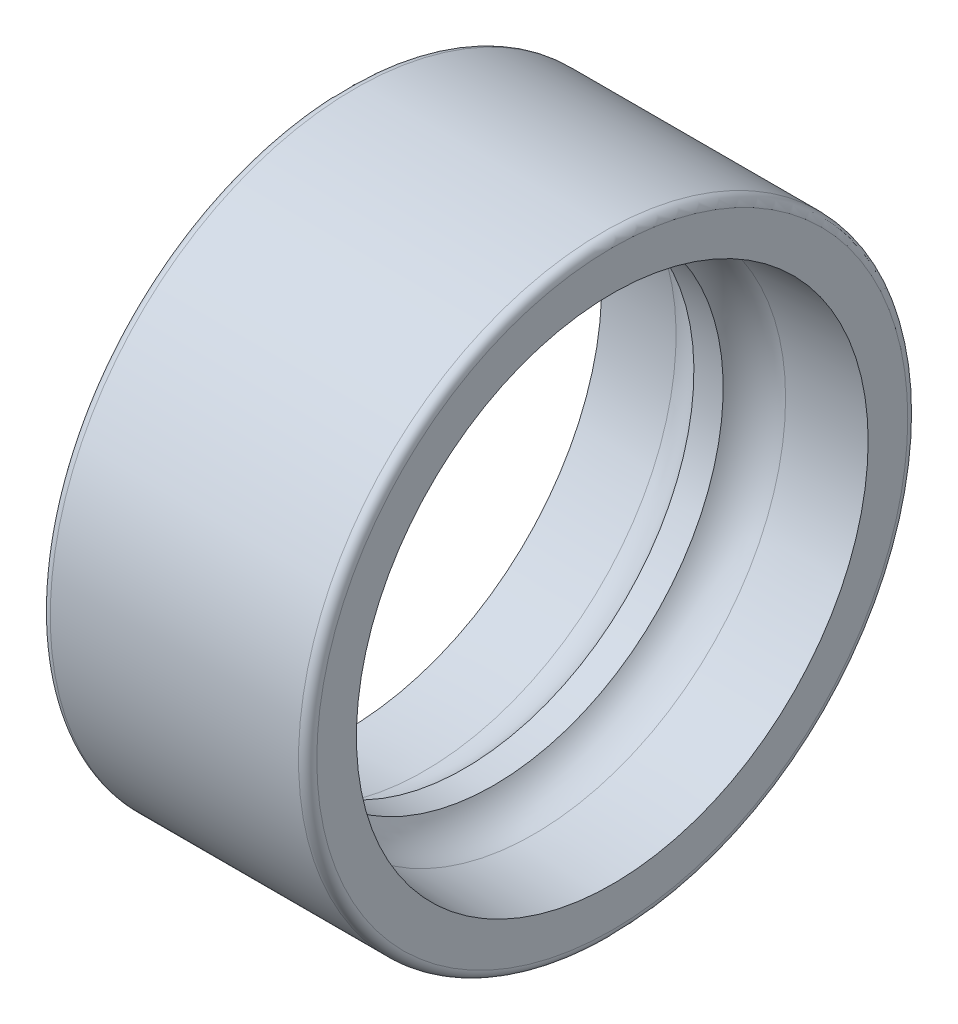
ISO-10303-21;
HEADER;
FILE_DESCRIPTION(('STEP AP214'),'2;1');
FILE_NAME('part.step','',(''),(''),'','','');
FILE_SCHEMA(('AUTOMOTIVE_DESIGN { 1 0 10303 214 1 1 1 1 }'));
ENDSEC;
DATA;
#1=APPLICATION_CONTEXT('core data for automotive mechanical design processes');
#2=APPLICATION_PROTOCOL_DEFINITION('international standard','automotive_design',2000,#1);
#3=PRODUCT_CONTEXT('',#1,'mechanical');
#4=PRODUCT('Part','Part','',(#3));
#5=PRODUCT_RELATED_PRODUCT_CATEGORY('part','',(#4));
#6=PRODUCT_DEFINITION_FORMATION('','',#4);
#7=PRODUCT_DEFINITION_CONTEXT('part definition',#1,'design');
#8=PRODUCT_DEFINITION('design','',#6,#7);
#9=PRODUCT_DEFINITION_SHAPE('','',#8);
#10=(LENGTH_UNIT() NAMED_UNIT(*) SI_UNIT(.MILLI.,.METRE.));
#11=(NAMED_UNIT(*) PLANE_ANGLE_UNIT() SI_UNIT($,.RADIAN.));
#12=(NAMED_UNIT(*) SI_UNIT($,.STERADIAN.) SOLID_ANGLE_UNIT());
#13=UNCERTAINTY_MEASURE_WITH_UNIT(LENGTH_MEASURE(1.E-05),#10,'distance_accuracy_value','');
#14=(GEOMETRIC_REPRESENTATION_CONTEXT(3) GLOBAL_UNCERTAINTY_ASSIGNED_CONTEXT((#13)) GLOBAL_UNIT_ASSIGNED_CONTEXT((#10,
#11,#12)) REPRESENTATION_CONTEXT('',''));
#15=CARTESIAN_POINT('',(0.,0.,0.));
#16=DIRECTION('',(0.,0.,1.));
#17=DIRECTION('',(1.,0.,0.));
#18=AXIS2_PLACEMENT_3D('',#15,#16,#17);
#19=CARTESIAN_POINT('',(0.,0.,0.));
#20=DIRECTION('',(1.,0.,0.));
#21=DIRECTION('',(0.,0.,-1.));
#22=AXIS2_PLACEMENT_3D('',#19,#20,#21);
#23=CYLINDRICAL_SURFACE('',#22,15.0714285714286);
#24=CARTESIAN_POINT('',(-0.960835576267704,0.,0.));
#25=DIRECTION('',(1.,0.,0.));
#26=DIRECTION('',(0.,1.,0.));
#27=AXIS2_PLACEMENT_3D('',#24,#25,#26);
#28=CIRCLE('',#27,15.0714285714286);
#29=CARTESIAN_POINT('',(-0.960835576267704,15.0714285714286,0.));
#30=VERTEX_POINT('',#29);
#31=EDGE_CURVE('E207',#30,#30,#28,.T.);
#32=ORIENTED_EDGE('',*,*,#31,.F.);
#33=EDGE_LOOP('',(#32));
#34=FACE_BOUND('',#33,.T.);
#35=CARTESIAN_POINT('',(0.960835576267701,0.,0.));
#36=DIRECTION('',(-1.,0.,0.));
#37=DIRECTION('',(0.,-1.,0.));
#38=AXIS2_PLACEMENT_3D('',#35,#36,#37);
#39=CIRCLE('',#38,15.0714285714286);
#40=CARTESIAN_POINT('',(0.960835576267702,-15.0714285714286,0.));
#41=VERTEX_POINT('',#40);
#42=EDGE_CURVE('E210',#41,#41,#39,.T.);
#43=ORIENTED_EDGE('',*,*,#42,.F.);
#44=EDGE_LOOP('',(#43));
#45=FACE_BOUND('',#44,.T.);
#46=ADVANCED_FACE('F16',(#34,#45),#23,.F.);
#47=CARTESIAN_POINT('',(-3.59561173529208,0.,0.));
#48=DIRECTION('',(1.,0.,0.));
#49=DIRECTION('',(0.,1.,0.));
#50=AXIS2_PLACEMENT_3D('',#47,#48,#49);
#51=TOROIDAL_SURFACE('',#50,13.4285714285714,3.105);
#52=ORIENTED_EDGE('',*,*,#31,.T.);
#53=EDGE_LOOP('',(#52));
#54=FACE_BOUND('',#53,.T.);
#55=CARTESIAN_POINT('',(-3.59561173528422,0.,0.));
#56=DIRECTION('',(-1.,0.,0.));
#57=DIRECTION('',(0.,1.,0.));
#58=AXIS2_PLACEMENT_3D('',#55,#56,#57);
#59=CIRCLE('',#58,16.5335714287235);
#60=CARTESIAN_POINT('',(-3.59561173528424,16.5335714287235,0.));
#61=VERTEX_POINT('',#60);
#62=EDGE_CURVE('E211',#61,#61,#59,.T.);
#63=ORIENTED_EDGE('',*,*,#62,.T.);
#64=EDGE_LOOP('',(#63));
#65=FACE_BOUND('',#64,.T.);
#66=ADVANCED_FACE('F154',(#54,#65),#51,.F.);
#67=CARTESIAN_POINT('',(3.59561173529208,0.,0.));
#68=DIRECTION('',(1.,0.,0.));
#69=DIRECTION('',(0.,1.,0.));
#70=AXIS2_PLACEMENT_3D('',#67,#68,#69);
#71=TOROIDAL_SURFACE('',#70,13.4285714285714,3.105);
#72=ORIENTED_EDGE('',*,*,#42,.T.);
#73=EDGE_LOOP('',(#72));
#74=FACE_BOUND('',#73,.T.);
#75=CARTESIAN_POINT('',(3.59561173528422,0.,0.));
#76=DIRECTION('',(1.,0.,0.));
#77=DIRECTION('',(0.,1.,0.));
#78=AXIS2_PLACEMENT_3D('',#75,#76,#77);
#79=CIRCLE('',#78,16.5335714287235);
#80=CARTESIAN_POINT('',(3.59561173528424,16.5335714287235,0.));
#81=VERTEX_POINT('',#80);
#82=EDGE_CURVE('E214',#81,#81,#79,.T.);
#83=ORIENTED_EDGE('',*,*,#82,.T.);
#84=EDGE_LOOP('',(#83));
#85=FACE_BOUND('',#84,.T.);
#86=ADVANCED_FACE('F18',(#74,#85),#71,.F.);
#87=CARTESIAN_POINT('',(-8.75000000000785,0.,0.));
#88=DIRECTION('',(-1.,0.,0.));
#89=DIRECTION('',(0.,0.,1.));
#90=AXIS2_PLACEMENT_3D('',#87,#88,#89);
#91=CONICAL_SURFACE('',#90,16.7999999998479,0.051643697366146);
#92=CARTESIAN_POINT('',(-8.75000000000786,0.,0.));
#93=DIRECTION('',(-1.,0.,0.));
#94=DIRECTION('',(0.,0.,1.));
#95=AXIS2_PLACEMENT_3D('',#92,#93,#94);
#96=CIRCLE('',#95,16.7999999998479);
#97=CARTESIAN_POINT('',(-8.75000000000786,0.,16.7999999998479));
#98=VERTEX_POINT('',#97);
#99=EDGE_CURVE('E220',#98,#98,#96,.F.);
#100=ORIENTED_EDGE('',*,*,#99,.F.);
#101=EDGE_LOOP('',(#100));
#102=FACE_BOUND('',#101,.T.);
#103=ORIENTED_EDGE('',*,*,#62,.F.);
#104=EDGE_LOOP('',(#103));
#105=FACE_BOUND('',#104,.T.);
#106=ADVANCED_FACE('F145',(#102,#105),#91,.F.);
#107=CARTESIAN_POINT('',(8.75000000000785,0.,0.));
#108=DIRECTION('',(1.,0.,0.));
#109=DIRECTION('',(0.,0.,-1.));
#110=AXIS2_PLACEMENT_3D('',#107,#108,#109);
#111=CONICAL_SURFACE('',#110,16.7999999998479,0.0516436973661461);
#112=ORIENTED_EDGE('',*,*,#82,.F.);
#113=EDGE_LOOP('',(#112));
#114=FACE_BOUND('',#113,.T.);
#115=CARTESIAN_POINT('',(8.75000000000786,0.,0.));
#116=DIRECTION('',(1.,0.,0.));
#117=DIRECTION('',(0.,0.,-1.));
#118=AXIS2_PLACEMENT_3D('',#115,#116,#117);
#119=CIRCLE('',#118,16.7999999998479);
#120=CARTESIAN_POINT('',(8.75000000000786,0.,-16.7999999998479));
#121=VERTEX_POINT('',#120);
#122=EDGE_CURVE('E63',#121,#121,#119,.F.);
#123=ORIENTED_EDGE('',*,*,#122,.F.);
#124=EDGE_LOOP('',(#123));
#125=FACE_BOUND('',#124,.T.);
#126=ADVANCED_FACE('F141',(#114,#125),#111,.F.);
#127=CARTESIAN_POINT('',(-8.75,18.1,0.));
#128=DIRECTION('',(-1.,0.,0.));
#129=DIRECTION('',(0.,0.,1.));
#130=AXIS2_PLACEMENT_3D('',#127,#128,#129);
#131=PLANE('',#130);
#132=ORIENTED_EDGE('',*,*,#99,.T.);
#133=EDGE_LOOP('',(#132));
#134=FACE_BOUND('',#133,.T.);
#135=CARTESIAN_POINT('',(-8.75,0.,0.));
#136=DIRECTION('',(1.,0.,0.));
#137=DIRECTION('',(0.,0.,-1.));
#138=AXIS2_PLACEMENT_3D('',#135,#136,#137);
#139=CIRCLE('',#138,19.4);
#140=CARTESIAN_POINT('',(-8.75,0.,-19.4));
#141=VERTEX_POINT('',#140);
#142=CARTESIAN_POINT('',(-8.75,19.4,0.));
#143=VERTEX_POINT('',#142);
#144=EDGE_CURVE('E55',#141,#143,#139,.T.);
#145=ORIENTED_EDGE('',*,*,#144,.F.);
#146=CARTESIAN_POINT('',(-8.75,0.,0.));
#147=DIRECTION('',(1.,0.,0.));
#148=DIRECTION('',(0.,0.,1.));
#149=AXIS2_PLACEMENT_3D('',#146,#147,#148);
#150=CIRCLE('',#149,19.4);
#151=CARTESIAN_POINT('',(-8.75,0.,19.4));
#152=VERTEX_POINT('',#151);
#153=EDGE_CURVE('E59',#152,#141,#150,.T.);
#154=ORIENTED_EDGE('',*,*,#153,.F.);
#155=CARTESIAN_POINT('',(-8.75,0.,0.));
#156=DIRECTION('',(1.,0.,0.));
#157=DIRECTION('',(0.,1.,0.));
#158=AXIS2_PLACEMENT_3D('',#155,#156,#157);
#159=CIRCLE('',#158,19.4);
#160=EDGE_CURVE('E52',#143,#152,#159,.T.);
#161=ORIENTED_EDGE('',*,*,#160,.F.);
#162=EDGE_LOOP('',(#145,#154,#161));
#163=FACE_BOUND('',#162,.T.);
#164=ADVANCED_FACE('F58',(#134,#163),#131,.T.);
#165=CARTESIAN_POINT('',(8.75,18.1,0.));
#166=DIRECTION('',(1.,0.,0.));
#167=DIRECTION('',(0.,0.,-1.));
#168=AXIS2_PLACEMENT_3D('',#165,#166,#167);
#169=PLANE('',#168);
#170=ORIENTED_EDGE('',*,*,#122,.T.);
#171=EDGE_LOOP('',(#170));
#172=FACE_BOUND('',#171,.T.);
#173=CARTESIAN_POINT('',(8.75,0.,0.));
#174=DIRECTION('',(-1.,0.,0.));
#175=DIRECTION('',(0.,0.,-1.));
#176=AXIS2_PLACEMENT_3D('',#173,#174,#175);
#177=CIRCLE('',#176,19.4);
#178=CARTESIAN_POINT('',(8.75,0.,-19.4));
#179=VERTEX_POINT('',#178);
#180=CARTESIAN_POINT('',(8.75,0.,19.4));
#181=VERTEX_POINT('',#180);
#182=EDGE_CURVE('E68',#179,#181,#177,.T.);
#183=ORIENTED_EDGE('',*,*,#182,.F.);
#184=CARTESIAN_POINT('',(8.75,0.,0.));
#185=DIRECTION('',(-1.,0.,0.));
#186=DIRECTION('',(0.,1.,0.));
#187=AXIS2_PLACEMENT_3D('',#184,#185,#186);
#188=CIRCLE('',#187,19.4);
#189=CARTESIAN_POINT('',(8.75,19.4,0.));
#190=VERTEX_POINT('',#189);
#191=EDGE_CURVE('E37',#190,#179,#188,.T.);
#192=ORIENTED_EDGE('',*,*,#191,.F.);
#193=CARTESIAN_POINT('',(8.75,0.,0.));
#194=DIRECTION('',(-1.,0.,0.));
#195=DIRECTION('',(0.,0.,1.));
#196=AXIS2_PLACEMENT_3D('',#193,#194,#195);
#197=CIRCLE('',#196,19.4);
#198=EDGE_CURVE('E111',#181,#190,#197,.T.);
#199=ORIENTED_EDGE('',*,*,#198,.F.);
#200=EDGE_LOOP('',(#183,#192,#199));
#201=FACE_BOUND('',#200,.T.);
#202=ADVANCED_FACE('F86',(#172,#201),#169,.T.);
#203=CARTESIAN_POINT('',(-8.15,0.,0.));
#204=DIRECTION('',(1.,0.,0.));
#205=DIRECTION('',(0.,0.,-1.));
#206=AXIS2_PLACEMENT_3D('',#203,#204,#205);
#207=TOROIDAL_SURFACE('',#206,19.4,0.6);
#208=CARTESIAN_POINT('',(-8.15,0.,0.));
#209=DIRECTION('',(1.,0.,0.));
#210=DIRECTION('',(0.,0.,-1.));
#211=AXIS2_PLACEMENT_3D('',#208,#209,#210);
#212=CIRCLE('',#211,20.);
#213=CARTESIAN_POINT('',(-8.15,0.,-20.));
#214=VERTEX_POINT('',#213);
#215=EDGE_CURVE('E28',#214,#214,#212,.T.);
#216=ORIENTED_EDGE('',*,*,#215,.F.);
#217=EDGE_LOOP('',(#216));
#218=FACE_BOUND('',#217,.T.);
#219=ORIENTED_EDGE('',*,*,#153,.T.);
#220=ORIENTED_EDGE('',*,*,#144,.T.);
#221=ORIENTED_EDGE('',*,*,#160,.T.);
#222=EDGE_LOOP('',(#219,#220,#221));
#223=FACE_BOUND('',#222,.T.);
#224=ADVANCED_FACE('F67',(#218,#223),#207,.T.);
#225=CARTESIAN_POINT('',(8.15,0.,0.));
#226=DIRECTION('',(1.,0.,0.));
#227=DIRECTION('',(0.,0.,-1.));
#228=AXIS2_PLACEMENT_3D('',#225,#226,#227);
#229=TOROIDAL_SURFACE('',#228,19.4,0.599999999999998);
#230=CARTESIAN_POINT('',(8.15,0.,0.));
#231=DIRECTION('',(1.,0.,0.));
#232=DIRECTION('',(0.,0.,-1.));
#233=AXIS2_PLACEMENT_3D('',#230,#231,#232);
#234=CIRCLE('',#233,20.);
#235=CARTESIAN_POINT('',(8.15,0.,-20.));
#236=VERTEX_POINT('',#235);
#237=EDGE_CURVE('E10',#236,#236,#234,.F.);
#238=ORIENTED_EDGE('',*,*,#237,.F.);
#239=EDGE_LOOP('',(#238));
#240=FACE_BOUND('',#239,.T.);
#241=ORIENTED_EDGE('',*,*,#198,.T.);
#242=ORIENTED_EDGE('',*,*,#191,.T.);
#243=ORIENTED_EDGE('',*,*,#182,.T.);
#244=EDGE_LOOP('',(#241,#242,#243));
#245=FACE_BOUND('',#244,.T.);
#246=ADVANCED_FACE('F85',(#240,#245),#229,.T.);
#247=CARTESIAN_POINT('',(0.,0.,0.));
#248=DIRECTION('',(1.,0.,0.));
#249=DIRECTION('',(0.,0.,-1.));
#250=AXIS2_PLACEMENT_3D('',#247,#248,#249);
#251=CYLINDRICAL_SURFACE('',#250,20.);
#252=ORIENTED_EDGE('',*,*,#215,.T.);
#253=EDGE_LOOP('',(#252));
#254=FACE_BOUND('',#253,.T.);
#255=ORIENTED_EDGE('',*,*,#237,.T.);
#256=EDGE_LOOP('',(#255));
#257=FACE_BOUND('',#256,.T.);
#258=ADVANCED_FACE('F124',(#254,#257),#251,.T.);
#259=CLOSED_SHELL('',(#46,#66,#86,#106,#126,#164,#202,#224,#246,#258));
#260=MANIFOLD_SOLID_BREP('B1',#259);
#261=ADVANCED_BREP_SHAPE_REPRESENTATION('',(#18,#260),#14);
#262=SHAPE_DEFINITION_REPRESENTATION(#9,#261);
ENDSEC;
END-ISO-10303-21;
